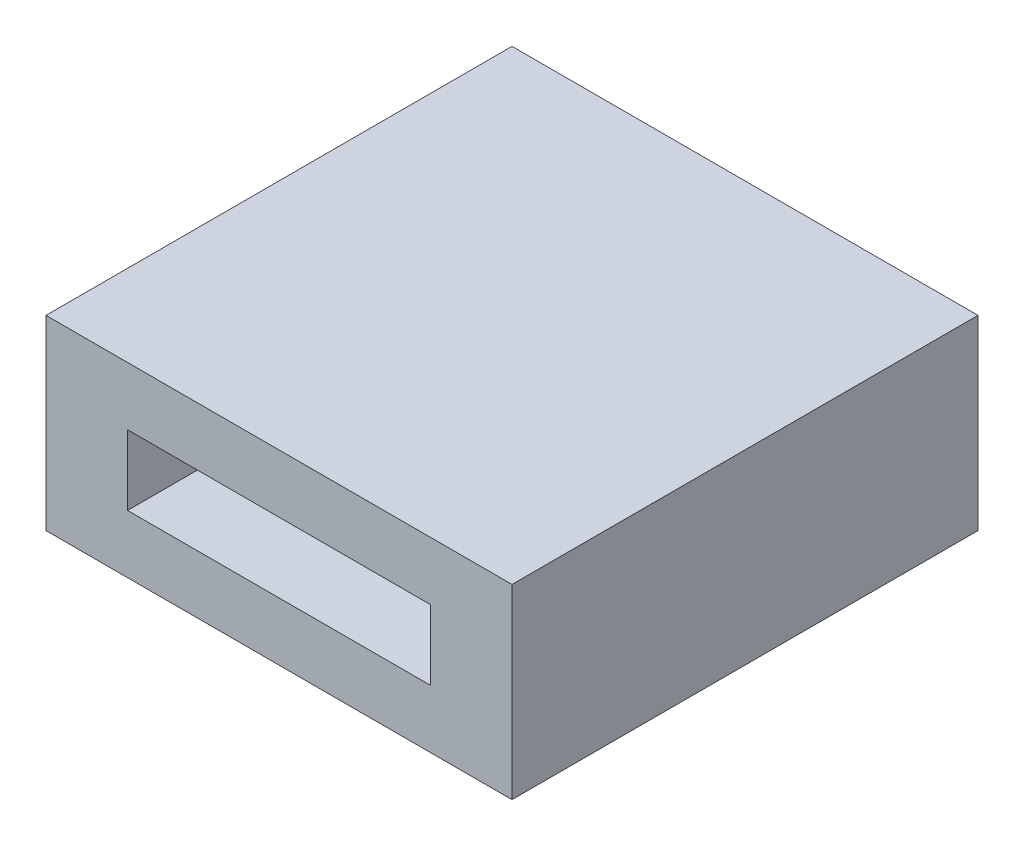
from build123d import *

# Parameters (mm, degrees)
SKETCH1_W          = 5.08
SKETCH1_H          = 2.032
EXTRUDE1_DEPTH     = 5.08
SKETCH2_W          = 3.302
SKETCH2_H          = 0.762
CUT_EXTRUDE1_DEPTH = 4.572


with BuildPart() as part:
    # Sketch1 → Extrude1 (new body)
    with BuildSketch(Plane.XY):
        with Locations((-15.220014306, 1.016)):
            Rectangle(SKETCH1_W, SKETCH1_H)
    extrude(amount=EXTRUDE1_DEPTH)

    # Sketch2 → Cut-Extrude1 (cut)
    with BuildSketch(Plane.XY.offset(5.08)):
        with Locations((-15.220014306, 1.016)):
            Rectangle(SKETCH2_W, SKETCH2_H)
    extrude(amount=-CUT_EXTRUDE1_DEPTH, mode=Mode.SUBTRACT)


solid = part.part
